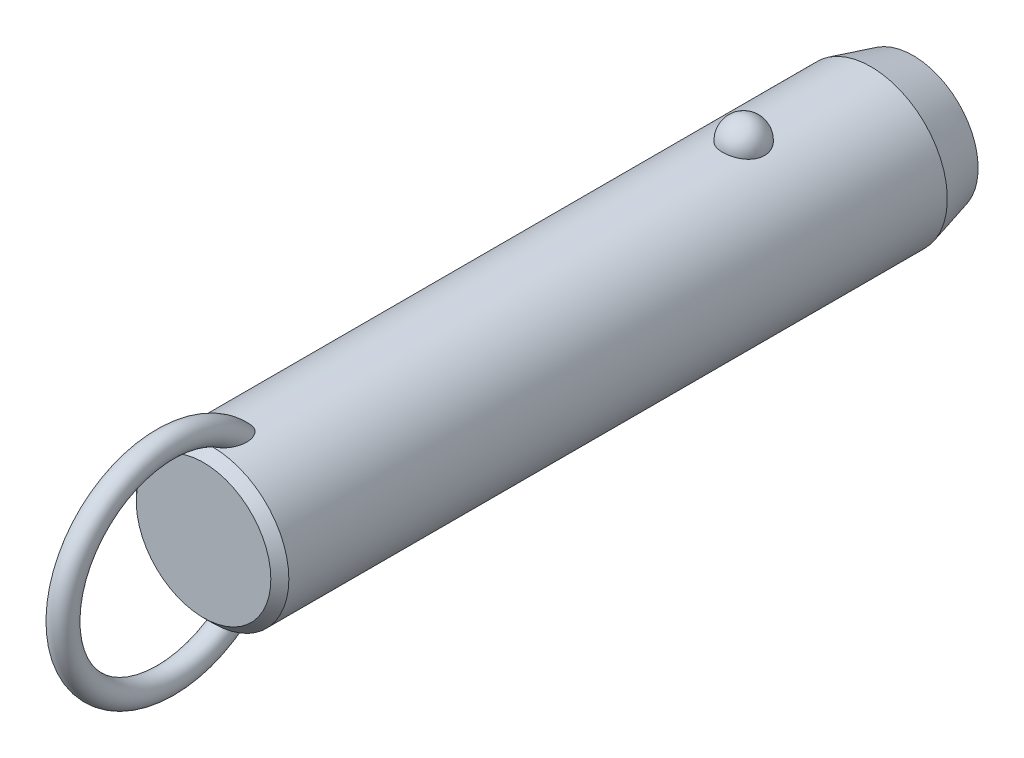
ISO-10303-21;
HEADER;
FILE_DESCRIPTION(('STEP AP214'),'2;1');
FILE_NAME('part.step','',(''),(''),'','','');
FILE_SCHEMA(('AUTOMOTIVE_DESIGN { 1 0 10303 214 1 1 1 1 }'));
ENDSEC;
DATA;
#1=APPLICATION_CONTEXT('core data for automotive mechanical design processes');
#2=APPLICATION_PROTOCOL_DEFINITION('international standard','automotive_design',2000,#1);
#3=PRODUCT_CONTEXT('',#1,'mechanical');
#4=PRODUCT('Part','Part','',(#3));
#5=PRODUCT_RELATED_PRODUCT_CATEGORY('part','',(#4));
#6=PRODUCT_DEFINITION_FORMATION('','',#4);
#7=PRODUCT_DEFINITION_CONTEXT('part definition',#1,'design');
#8=PRODUCT_DEFINITION('design','',#6,#7);
#9=PRODUCT_DEFINITION_SHAPE('','',#8);
#10=(LENGTH_UNIT() NAMED_UNIT(*) SI_UNIT(.MILLI.,.METRE.));
#11=(NAMED_UNIT(*) PLANE_ANGLE_UNIT() SI_UNIT($,.RADIAN.));
#12=(NAMED_UNIT(*) SI_UNIT($,.STERADIAN.) SOLID_ANGLE_UNIT());
#13=UNCERTAINTY_MEASURE_WITH_UNIT(LENGTH_MEASURE(1.E-05),#10,'distance_accuracy_value','');
#14=(GEOMETRIC_REPRESENTATION_CONTEXT(3) GLOBAL_UNCERTAINTY_ASSIGNED_CONTEXT((#13)) GLOBAL_UNIT_ASSIGNED_CONTEXT((#10,
#11,#12)) REPRESENTATION_CONTEXT('',''));
#15=CARTESIAN_POINT('',(0.,0.,0.));
#16=DIRECTION('',(0.,0.,1.));
#17=DIRECTION('',(1.,0.,0.));
#18=AXIS2_PLACEMENT_3D('',#15,#16,#17);
#19=CARTESIAN_POINT('',(0.,0.,73.7));
#20=DIRECTION('',(0.,0.,-1.));
#21=DIRECTION('',(-1.,0.,0.));
#22=AXIS2_PLACEMENT_3D('',#19,#20,#21);
#23=CYLINDRICAL_SURFACE('',#22,12.7);
#24=CARTESIAN_POINT('',(3.46661256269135,12.2177165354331,-3.5));
#25=CARTESIAN_POINT('',(3.4666090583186,12.2177194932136,-3.30432790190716));
#26=CARTESIAN_POINT('',(3.45063567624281,12.2222841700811,-3.10861112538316));
#27=CARTESIAN_POINT('',(3.38712451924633,12.2400345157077,-2.72271899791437));
#28=CARTESIAN_POINT('',(3.33957415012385,12.2532236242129,-2.53254588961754));
#29=CARTESIAN_POINT('',(3.2141234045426,12.286724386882,-2.16324948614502));
#30=CARTESIAN_POINT('',(3.13623639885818,12.3070329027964,-1.98412136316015));
#31=CARTESIAN_POINT('',(2.95205930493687,12.3525018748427,-1.64180592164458));
#32=CARTESIAN_POINT('',(2.84577003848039,12.3776621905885,-1.47861814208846));
#33=CARTESIAN_POINT('',(2.60688050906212,12.4301712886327,-1.17190583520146));
#34=CARTESIAN_POINT('',(2.47415697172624,12.4575299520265,-1.02847897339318));
#35=CARTESIAN_POINT('',(2.18615174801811,12.5112810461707,-0.766177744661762));
#36=CARTESIAN_POINT('',(2.03087002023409,12.5376734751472,-0.64730342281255));
#37=CARTESIAN_POINT('',(1.70237334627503,12.5864761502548,-0.437732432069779));
#38=CARTESIAN_POINT('',(1.52920948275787,12.6088972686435,-0.346958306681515));
#39=CARTESIAN_POINT('',(1.16944170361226,12.6473352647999,-0.195750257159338));
#40=CARTESIAN_POINT('',(0.982839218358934,12.663352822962,-0.135313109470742));
#41=CARTESIAN_POINT('',(0.604961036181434,12.6869706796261,-0.0473241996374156));
#42=CARTESIAN_POINT('',(0.41382314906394,12.6947125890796,-0.0192185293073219));
#43=CARTESIAN_POINT('',(0.0293827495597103,12.7014203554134,0.0051725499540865));
#44=CARTESIAN_POINT('',(-0.163919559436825,12.7003870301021,0.00146092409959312));
#45=CARTESIAN_POINT('',(-0.544374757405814,12.689735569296,-0.0373939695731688));
#46=CARTESIAN_POINT('',(-0.731575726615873,12.6802364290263,-0.0721015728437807));
#47=CARTESIAN_POINT('',(-1.09733277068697,12.6538333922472,-0.171364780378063));
#48=CARTESIAN_POINT('',(-1.27588869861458,12.6369293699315,-0.235920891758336));
#49=CARTESIAN_POINT('',(-1.6204698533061,12.5973946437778,-0.393548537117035));
#50=CARTESIAN_POINT('',(-1.78641865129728,12.5747321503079,-0.486778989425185));
#51=CARTESIAN_POINT('',(-2.10030671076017,12.5261316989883,-0.699110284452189));
#52=CARTESIAN_POINT('',(-2.24824419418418,12.5001934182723,-0.818213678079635));
#53=CARTESIAN_POINT('',(-2.52491489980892,12.4472906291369,-1.08157124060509));
#54=CARTESIAN_POINT('',(-2.65324222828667,12.4203160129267,-1.22624992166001));
#55=CARTESIAN_POINT('',(-2.88410007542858,12.3687509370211,-1.53528325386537));
#56=CARTESIAN_POINT('',(-2.98662883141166,12.3441606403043,-1.69963924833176));
#57=CARTESIAN_POINT('',(-3.16432417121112,12.2998199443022,-2.04548497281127));
#58=CARTESIAN_POINT('',(-3.23917525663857,12.2801261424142,-2.22714424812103));
#59=CARTESIAN_POINT('',(-3.35800573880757,12.248167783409,-2.6009138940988));
#60=CARTESIAN_POINT('',(-3.4019860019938,12.2359030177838,-2.79302397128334));
#61=CARTESIAN_POINT('',(-3.45784812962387,12.2202347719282,-3.18140279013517));
#62=CARTESIAN_POINT('',(-3.46986123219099,12.2167950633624,-3.37765118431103));
#63=CARTESIAN_POINT('',(-3.46186273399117,12.2190638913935,-3.76943689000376));
#64=CARTESIAN_POINT('',(-3.44185196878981,12.2247721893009,-3.96497421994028));
#65=CARTESIAN_POINT('',(-3.37048652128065,12.2446381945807,-4.34881728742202));
#66=CARTESIAN_POINT('',(-3.31928253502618,12.2587552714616,-4.53715319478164));
#67=CARTESIAN_POINT('',(-3.18693461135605,12.2938237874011,-4.90231727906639));
#68=CARTESIAN_POINT('',(-3.1057895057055,12.3147754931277,-5.07914500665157));
#69=CARTESIAN_POINT('',(-2.91506431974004,12.3613125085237,-5.41732059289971));
#70=CARTESIAN_POINT('',(-2.80533587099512,12.3869217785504,-5.57858147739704));
#71=CARTESIAN_POINT('',(-2.560414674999,12.4398525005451,-5.88013283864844));
#72=CARTESIAN_POINT('',(-2.42522099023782,12.4671740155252,-6.02042254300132));
#73=CARTESIAN_POINT('',(-2.1323357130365,12.5205965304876,-6.27662798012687));
#74=CARTESIAN_POINT('',(-1.97456596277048,12.5466928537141,-6.3924554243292));
#75=CARTESIAN_POINT('',(-1.64115839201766,12.5946384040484,-6.59583547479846));
#76=CARTESIAN_POINT('',(-1.46552179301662,12.6164879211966,-6.68339001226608));
#77=CARTESIAN_POINT('',(-1.10356050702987,12.6532533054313,-6.82682153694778));
#78=CARTESIAN_POINT('',(-0.9173913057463,12.6682500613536,-6.8830698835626));
#79=CARTESIAN_POINT('',(-0.537836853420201,12.6900288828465,-6.96386887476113));
#80=CARTESIAN_POINT('',(-0.344452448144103,12.6968119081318,-6.9884232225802));
#81=CARTESIAN_POINT('',(0.0402577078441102,12.7013667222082,-7.00496469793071));
#82=CARTESIAN_POINT('',(0.231556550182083,12.6993008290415,-6.99753844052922));
#83=CARTESIAN_POINT('',(0.610105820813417,12.6867505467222,-6.9516636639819));
#84=CARTESIAN_POINT('',(0.797356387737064,12.6762664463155,-6.913216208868));
#85=CARTESIAN_POINT('',(1.16186657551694,12.6480587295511,-6.80658431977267));
#86=CARTESIAN_POINT('',(1.33915951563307,12.6303611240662,-6.73850666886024));
#87=CARTESIAN_POINT('',(1.67968518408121,12.5896027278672,-6.5745087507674));
#88=CARTESIAN_POINT('',(1.84291705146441,12.5665416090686,-6.47858678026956));
#89=CARTESIAN_POINT('',(2.15340192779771,12.5171072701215,-6.25982455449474));
#90=CARTESIAN_POINT('',(2.30037831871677,12.4906895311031,-6.13660186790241));
#91=CARTESIAN_POINT('',(2.5717412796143,12.4376567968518,-5.86739587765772));
#92=CARTESIAN_POINT('',(2.69612388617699,12.4110417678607,-5.72140858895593));
#93=CARTESIAN_POINT('',(2.92107785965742,12.360051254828,-5.40794137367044));
#94=CARTESIAN_POINT('',(3.02121329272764,12.3357209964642,-5.24014110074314));
#95=CARTESIAN_POINT('',(3.19236291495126,12.2925446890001,-4.88969865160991));
#96=CARTESIAN_POINT('',(3.26338839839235,12.2736965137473,-4.70706226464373));
#97=CARTESIAN_POINT('',(3.36788038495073,12.245404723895,-4.35469510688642));
#98=CARTESIAN_POINT('',(3.40484026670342,12.2351018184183,-4.18605935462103));
#99=CARTESIAN_POINT('',(3.45420764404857,12.2212564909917,-3.84496058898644));
#100=CARTESIAN_POINT('',(3.46661565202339,12.2177139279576,-3.67249765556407));
#101=CARTESIAN_POINT('',(3.46661256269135,12.2177165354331,-3.5));
#102=B_SPLINE_CURVE_WITH_KNOTS('',3,(#24,#25,#26,#27,#28,#29,#30,#31,#32,#33,#34,#35,#36,#37,
#38,#39,#40,#41,#42,#43,#44,#45,#46,#47,#48,#49,#50,#51,#52,#53,#54,#55,#56,#57,#58,#59,#60,#61,
#62,#63,#64,#65,#66,#67,#68,#69,#70,#71,#72,#73,#74,#75,#76,#77,#78,#79,#80,#81,#82,#83,#84,#85,
#86,#87,#88,#89,#90,#91,#92,#93,#94,#95,#96,#97,#98,#99,#100,#101),.UNSPECIFIED.,.T.,.F.,(4,2,2,
2,2,2,2,2,2,2,2,2,2,2,2,2,2,2,2,2,2,2,2,2,2,2,2,2,2,2,2,2,2,2,2,2,2,2,4),(0.,0.586396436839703,
1.17302689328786,1.7593990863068,2.34575431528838,2.93491084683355,3.52406845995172,
4.11158733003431,4.69904375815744,5.2762784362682,5.85345931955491,6.42265312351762,
6.99185659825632,7.56427334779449,8.136746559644,8.71981013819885,9.3029135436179,
9.89247258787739,10.4820150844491,11.0691335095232,11.6562366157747,12.2405256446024,
12.8248374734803,13.412244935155,13.9996740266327,14.5891883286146,15.1786623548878,
15.7609861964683,16.3432419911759,16.9148635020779,17.4864654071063,18.0560241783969,
18.6256177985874,19.2037609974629,19.7820055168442,20.3699810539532,20.957728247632,
21.4746855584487,21.9916320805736),.UNSPECIFIED.);
#103=CARTESIAN_POINT('',(3.46661256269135,12.2177165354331,-3.5));
#104=VERTEX_POINT('',#103);
#105=EDGE_CURVE('E41',#104,#104,#102,.T.);
#106=ORIENTED_EDGE('',*,*,#105,.T.);
#107=EDGE_LOOP('',(#106));
#108=FACE_BOUND('',#107,.T.);
#109=CARTESIAN_POINT('',(0.,0.,84.9));
#110=DIRECTION('',(0.,0.,1.));
#111=DIRECTION('',(1.,0.,0.));
#112=AXIS2_PLACEMENT_3D('',#109,#110,#111);
#113=CIRCLE('',#112,12.7);
#114=CARTESIAN_POINT('',(12.7,0.,84.9));
#115=VERTEX_POINT('',#114);
#116=EDGE_CURVE('E10',#115,#115,#113,.F.);
#117=ORIENTED_EDGE('',*,*,#116,.T.);
#118=EDGE_LOOP('',(#117));
#119=FACE_BOUND('',#118,.T.);
#120=CARTESIAN_POINT('',(-0.548122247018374,-12.6881662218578,78.6432187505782));
#121=CARTESIAN_POINT('',(-0.64886572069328,-12.6838128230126,78.677926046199));
#122=CARTESIAN_POINT('',(-0.746398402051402,-12.6783867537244,78.7220428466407));
#123=CARTESIAN_POINT('',(-0.93212506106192,-12.666091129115,78.8267647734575));
#124=CARTESIAN_POINT('',(-1.02030388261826,-12.6592192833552,78.887396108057));
#125=CARTESIAN_POINT('',(-1.18487740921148,-12.6448747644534,79.021847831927));
#126=CARTESIAN_POINT('',(-1.26134296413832,-12.637406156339,79.0955825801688));
#127=CARTESIAN_POINT('',(-1.4023120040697,-12.6225412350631,79.2536045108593));
#128=CARTESIAN_POINT('',(-1.46681470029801,-12.6151449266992,79.3378923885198));
#129=CARTESIAN_POINT('',(-1.60714786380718,-12.5981718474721,79.5496577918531));
#130=CARTESIAN_POINT('',(-1.67725126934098,-12.588900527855,79.680962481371));
#131=CARTESIAN_POINT('',(-1.79536591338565,-12.5725964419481,79.9532471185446));
#132=CARTESIAN_POINT('',(-1.84333535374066,-12.5655679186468,80.0942447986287));
#133=CARTESIAN_POINT('',(-1.93422576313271,-12.5519624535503,80.4376455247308));
#134=CARTESIAN_POINT('',(-1.96788773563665,-12.5466298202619,80.6425578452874));
#135=CARTESIAN_POINT('',(-1.9941399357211,-12.542463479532,80.9517600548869));
#136=CARTESIAN_POINT('',(-1.99883864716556,-12.5417153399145,81.0552987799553));
#137=CARTESIAN_POINT('',(-2.00078003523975,-12.5414074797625,81.2624512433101));
#138=CARTESIAN_POINT('',(-1.99802449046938,-12.5418474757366,81.3660649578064));
#139=CARTESIAN_POINT('',(-1.98336733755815,-12.5441750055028,81.6103207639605));
#140=CARTESIAN_POINT('',(-1.96851430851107,-12.5465291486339,81.7507804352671));
#141=CARTESIAN_POINT('',(-1.92707089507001,-12.5529612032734,82.0299607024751));
#142=CARTESIAN_POINT('',(-1.900474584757,-12.5570399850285,82.1686803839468));
#143=CARTESIAN_POINT('',(-1.83619120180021,-12.5666008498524,82.4434113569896));
#144=CARTESIAN_POINT('',(-1.79850828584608,-12.57208240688,82.5794236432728));
#145=CARTESIAN_POINT('',(-1.71223796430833,-12.5841228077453,82.8478421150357));
#146=CARTESIAN_POINT('',(-1.6636567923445,-12.5906810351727,82.9802503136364));
#147=CARTESIAN_POINT('',(-1.57804503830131,-12.6016176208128,83.1854887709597));
#148=CARTESIAN_POINT('',(-1.54477252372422,-12.6057501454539,83.2599149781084));
#149=CARTESIAN_POINT('',(-1.47424480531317,-12.6141930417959,83.4068393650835));
#150=CARTESIAN_POINT('',(-1.43699041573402,-12.6185033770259,83.4793379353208));
#151=CARTESIAN_POINT('',(-1.35825795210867,-12.6272207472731,83.6218926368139));
#152=CARTESIAN_POINT('',(-1.31678520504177,-12.6316276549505,83.6919517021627));
#153=CARTESIAN_POINT('',(-1.22917793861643,-12.6404532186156,83.8290705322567));
#154=CARTESIAN_POINT('',(-1.18304514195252,-12.6448718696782,83.8961313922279));
#155=CARTESIAN_POINT('',(-1.07246411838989,-12.6547893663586,84.0438741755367));
#156=CARTESIAN_POINT('',(-1.00642239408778,-12.6602600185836,84.1233844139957));
#157=CARTESIAN_POINT('',(-0.864441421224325,-12.6707460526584,84.2731698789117));
#158=CARTESIAN_POINT('',(-0.788516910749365,-12.6757620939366,84.3434585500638));
#159=CARTESIAN_POINT('',(-0.652215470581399,-12.6833591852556,84.4486801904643));
#160=CARTESIAN_POINT('',(-0.594982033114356,-12.6861973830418,84.4876241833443));
#161=CARTESIAN_POINT('',(-0.475269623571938,-12.6912445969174,84.5564899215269));
#162=CARTESIAN_POINT('',(-0.412800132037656,-12.6934547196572,84.5864275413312));
#163=CARTESIAN_POINT('',(-0.295749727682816,-12.6966636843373,84.6297565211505));
#164=CARTESIAN_POINT('',(-0.241949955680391,-12.6978134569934,84.6452188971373));
#165=CARTESIAN_POINT('',(-0.132508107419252,-12.6994261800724,84.6668845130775));
#166=CARTESIAN_POINT('',(-0.0768679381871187,-12.6998898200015,84.6730970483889));
#167=CARTESIAN_POINT('',(0.0347696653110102,-12.7000752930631,84.6755838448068));
#168=CARTESIAN_POINT('',(0.090767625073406,-12.6997954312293,84.6718353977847));
#169=CARTESIAN_POINT('',(0.201283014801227,-12.6985255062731,84.6547883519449));
#170=CARTESIAN_POINT('',(0.255799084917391,-12.6975348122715,84.6414812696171));
#171=CARTESIAN_POINT('',(0.376042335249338,-12.6946091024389,84.6020379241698));
#172=CARTESIAN_POINT('',(0.440950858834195,-12.6924943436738,84.5734492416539));
#173=CARTESIAN_POINT('',(0.565350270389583,-12.6875639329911,84.5063234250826));
#174=CARTESIAN_POINT('',(0.624828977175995,-12.6847467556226,84.4677646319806));
#175=CARTESIAN_POINT('',(0.774116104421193,-12.6767252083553,84.356949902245));
#176=CARTESIAN_POINT('',(0.859449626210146,-12.6711344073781,84.2787605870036));
#177=CARTESIAN_POINT('',(1.01789440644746,-12.6593922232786,84.110943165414));
#178=CARTESIAN_POINT('',(1.09096902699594,-12.653239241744,84.021282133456));
#179=CARTESIAN_POINT('',(1.22268793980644,-12.6411674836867,83.840265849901));
#180=CARTESIAN_POINT('',(1.28193986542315,-12.6352572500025,83.749345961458));
#181=CARTESIAN_POINT('',(1.39259777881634,-12.6235401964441,83.5627929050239));
#182=CARTESIAN_POINT('',(1.44399707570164,-12.6177334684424,83.4671558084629));
#183=CARTESIAN_POINT('',(1.53972870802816,-12.6064093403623,83.2722738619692));
#184=CARTESIAN_POINT('',(1.58405262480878,-12.6008922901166,83.1730248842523));
#185=CARTESIAN_POINT('',(1.66600705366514,-12.5903187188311,82.9717727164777));
#186=CARTESIAN_POINT('',(1.70363651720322,-12.5852622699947,82.8697690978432));
#187=CARTESIAN_POINT('',(1.77545379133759,-12.5753406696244,82.6543580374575));
#188=CARTESIAN_POINT('',(1.80903453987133,-12.5705328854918,82.540745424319));
#189=CARTESIAN_POINT('',(1.86844163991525,-12.5618400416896,82.3114575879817));
#190=CARTESIAN_POINT('',(1.89426665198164,-12.5579551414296,82.1957820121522));
#191=CARTESIAN_POINT('',(1.93785464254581,-12.5513030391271,81.9630072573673));
#192=CARTESIAN_POINT('',(1.95562640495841,-12.5485346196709,81.8459097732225));
#193=CARTESIAN_POINT('',(1.98264463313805,-12.5442934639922,81.6107473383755));
#194=CARTESIAN_POINT('',(1.99189298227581,-12.5428204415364,81.4926826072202));
#195=CARTESIAN_POINT('',(2.00416068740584,-12.540871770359,81.1806225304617));
#196=CARTESIAN_POINT('',(1.99944433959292,-12.541631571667,80.986229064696));
#197=CARTESIAN_POINT('',(1.96113755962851,-12.5476846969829,80.6003095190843));
#198=CARTESIAN_POINT('',(1.92758341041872,-12.5529723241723,80.4087801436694));
#199=CARTESIAN_POINT('',(1.83934342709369,-12.5661532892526,80.0822728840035));
#200=CARTESIAN_POINT('',(1.79215440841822,-12.5730485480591,79.9452499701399));
#201=CARTESIAN_POINT('',(1.67676242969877,-12.588958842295,79.6804459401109));
#202=CARTESIAN_POINT('',(1.60859050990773,-12.597970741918,79.5526515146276));
#203=CARTESIAN_POINT('',(1.46583832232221,-12.6152829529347,79.3358006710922));
#204=CARTESIAN_POINT('',(1.39525727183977,-12.6233659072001,79.2441050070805));
#205=CARTESIAN_POINT('',(1.23992594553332,-12.6395676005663,79.0734854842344));
#206=CARTESIAN_POINT('',(1.15517932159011,-12.6476863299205,78.9945583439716));
#207=CARTESIAN_POINT('',(0.971995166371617,-12.6630846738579,78.8526438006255));
#208=CARTESIAN_POINT('',(0.873456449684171,-12.6703572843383,78.7897849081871));
#209=CARTESIAN_POINT('',(0.665847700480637,-12.6829569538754,78.6844870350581));
#210=CARTESIAN_POINT('',(0.556784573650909,-12.688285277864,78.6420347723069));
#211=CARTESIAN_POINT('',(0.347338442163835,-12.6956226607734,78.5844434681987));
#212=CARTESIAN_POINT('',(0.247759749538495,-12.6979816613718,78.5663996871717));
#213=CARTESIAN_POINT('',(0.0470218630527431,-12.7003077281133,78.5486007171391));
#214=CARTESIAN_POINT('',(-0.0541350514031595,-12.7002779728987,78.5488212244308));
#215=CARTESIAN_POINT('',(-0.221414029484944,-12.6982482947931,78.5643639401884));
#216=CARTESIAN_POINT('',(-0.288055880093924,-12.6969033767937,78.5746662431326));
#217=CARTESIAN_POINT('',(-0.419599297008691,-12.6932369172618,78.6031348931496));
#218=CARTESIAN_POINT('',(-0.484501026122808,-12.6909154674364,78.6213005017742));
#219=CARTESIAN_POINT('',(-0.548122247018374,-12.6881662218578,78.6432187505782));
#220=B_SPLINE_CURVE_WITH_KNOTS('',3,(#120,#121,#122,#123,#124,#125,#126,#127,#128,#129,#130,
#131,#132,#133,#134,#135,#136,#137,#138,#139,#140,#141,#142,#143,#144,#145,#146,#147,#148,#149,
#150,#151,#152,#153,#154,#155,#156,#157,#158,#159,#160,#161,#162,#163,#164,#165,#166,#167,#168,
#169,#170,#171,#172,#173,#174,#175,#176,#177,#178,#179,#180,#181,#182,#183,#184,#185,#186,#187,
#188,#189,#190,#191,#192,#193,#194,#195,#196,#197,#198,#199,#200,#201,#202,#203,#204,#205,#206,
#207,#208,#209,#210,#211,#212,#213,#214,#215,#216,#217,#218,#219),.UNSPECIFIED.,.T.,.F.,(4,2,2,
2,2,2,2,2,2,2,2,2,2,2,2,2,2,2,2,2,2,2,2,2,2,2,2,2,2,2,2,2,2,2,2,2,2,2,2,2,2,2,2,2,2,2,2,2,2,4),
(0.,0.319642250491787,0.639794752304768,0.957927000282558,1.27608021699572,1.72100165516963,
2.16675988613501,2.78630021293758,3.09705782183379,3.40774128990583,3.83096358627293,
4.25439969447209,4.67767724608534,5.1007133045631,5.34550297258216,5.59024267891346,
5.83467707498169,6.07902143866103,6.38891080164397,6.69834321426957,6.90560910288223,
7.11250749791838,7.279773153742,7.44687060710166,7.6143493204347,7.78197685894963,
7.99365544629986,8.20579780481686,8.55147335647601,8.89816429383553,9.22375138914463,
9.54961437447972,9.87586224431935,10.202161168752,10.5575872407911,10.9130746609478,
11.2681734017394,11.6231936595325,12.2046601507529,12.7853961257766,13.219164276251,
13.6522938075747,13.9989174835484,14.3454519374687,14.6946768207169,15.0436740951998,
15.3457513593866,15.6474266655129,15.8493051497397,16.0511646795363),.UNSPECIFIED.);
#221=CARTESIAN_POINT('',(-0.548122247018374,-12.6881662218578,78.6432187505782));
#222=VERTEX_POINT('',#221);
#223=EDGE_CURVE('E60',#222,#222,#220,.T.);
#224=ORIENTED_EDGE('',*,*,#223,.T.);
#225=EDGE_LOOP('',(#224));
#226=FACE_BOUND('',#225,.T.);
#227=CARTESIAN_POINT('',(-0.548122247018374,12.6881662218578,78.6432187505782));
#228=CARTESIAN_POINT('',(-0.459436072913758,12.6919968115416,78.612673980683));
#229=CARTESIAN_POINT('',(-0.368189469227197,12.6949996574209,78.5893913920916));
#230=CARTESIAN_POINT('',(-0.183024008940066,12.6990186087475,78.5584062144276));
#231=CARTESIAN_POINT('',(-0.0891049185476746,12.7000345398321,78.5507049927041));
#232=CARTESIAN_POINT('',(0.0987147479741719,12.6999636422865,78.5512455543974));
#233=CARTESIAN_POINT('',(0.192615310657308,12.6988761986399,78.5594920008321));
#234=CARTESIAN_POINT('',(0.377658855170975,12.6947211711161,78.5915515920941));
#235=CARTESIAN_POINT('',(0.468801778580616,12.6916535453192,78.6153650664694));
#236=CARTESIAN_POINT('',(0.645809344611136,12.6838788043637,78.6774565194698));
#237=CARTESIAN_POINT('',(0.731679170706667,12.6791733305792,78.715720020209));
#238=CARTESIAN_POINT('',(0.896315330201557,12.6686004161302,78.805120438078));
#239=CARTESIAN_POINT('',(0.975080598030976,12.6627328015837,78.8562592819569));
#240=CARTESIAN_POINT('',(1.12963655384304,12.6499161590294,78.9736782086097));
#241=CARTESIAN_POINT('',(1.20478673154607,12.6429194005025,79.0407929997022));
#242=CARTESIAN_POINT('',(1.34448241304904,12.6288282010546,79.1852250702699));
#243=CARTESIAN_POINT('',(1.40902173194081,12.621733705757,79.2625482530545));
#244=CARTESIAN_POINT('',(1.55208211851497,12.6050877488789,79.4592475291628));
#245=CARTESIAN_POINT('',(1.62510490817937,12.5957546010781,79.5826540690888));
#246=CARTESIAN_POINT('',(1.7501904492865,12.5789823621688,79.8397690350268));
#247=CARTESIAN_POINT('',(1.80221377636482,12.5715468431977,79.973496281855));
#248=CARTESIAN_POINT('',(1.90309965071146,12.5567434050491,80.2983516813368));
#249=CARTESIAN_POINT('',(1.94342317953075,12.5504515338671,80.4921611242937));
#250=CARTESIAN_POINT('',(1.99332997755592,12.5426147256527,80.8837881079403));
#251=CARTESIAN_POINT('',(2.00285305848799,12.5410790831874,81.0816127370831));
#252=CARTESIAN_POINT('',(1.99678999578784,12.5420407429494,81.4166427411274));
#253=CARTESIAN_POINT('',(1.98794117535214,12.5434564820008,81.5540428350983));
#254=CARTESIAN_POINT('',(1.95865119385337,12.5480641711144,81.8276394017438));
#255=CARTESIAN_POINT('',(1.9382043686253,12.5512569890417,81.9638352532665));
#256=CARTESIAN_POINT('',(1.88647896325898,12.5591352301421,82.2342493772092));
#257=CARTESIAN_POINT('',(1.85518800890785,12.5638223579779,82.3684652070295));
#258=CARTESIAN_POINT('',(1.78217886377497,12.5743868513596,82.6339362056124));
#259=CARTESIAN_POINT('',(1.74046509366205,12.5802637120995,82.7651926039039));
#260=CARTESIAN_POINT('',(1.66024095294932,12.5910571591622,82.9860855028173));
#261=CARTESIAN_POINT('',(1.62434772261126,12.5957535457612,83.0766904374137));
#262=CARTESIAN_POINT('',(1.54709009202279,12.6054762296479,83.2555125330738));
#263=CARTESIAN_POINT('',(1.50572681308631,12.6105024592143,83.3437301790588));
#264=CARTESIAN_POINT('',(1.41728020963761,12.620748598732,83.5169321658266));
#265=CARTESIAN_POINT('',(1.37021377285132,12.625967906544,83.6019251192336));
#266=CARTESIAN_POINT('',(1.2696962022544,12.6364721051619,83.7680072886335));
#267=CARTESIAN_POINT('',(1.21624929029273,12.6417569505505,83.8490990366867));
#268=CARTESIAN_POINT('',(1.10304413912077,12.6521331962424,84.0047027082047));
#269=CARTESIAN_POINT('',(1.04340936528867,12.657226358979,84.0793033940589));
#270=CARTESIAN_POINT('',(0.915919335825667,12.6670906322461,84.221324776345));
#271=CARTESIAN_POINT('',(0.848064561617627,12.6718617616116,84.2887458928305));
#272=CARTESIAN_POINT('',(0.717035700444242,12.67987711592,84.4006247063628));
#273=CARTESIAN_POINT('',(0.655526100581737,12.6832377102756,84.4469970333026));
#274=CARTESIAN_POINT('',(0.525985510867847,12.6892676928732,84.5296195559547));
#275=CARTESIAN_POINT('',(0.457969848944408,12.6919386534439,84.5658927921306));
#276=CARTESIAN_POINT('',(0.334859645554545,12.695691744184,84.6166572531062));
#277=CARTESIAN_POINT('',(0.281116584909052,12.6970073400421,84.6343733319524));
#278=CARTESIAN_POINT('',(0.17142581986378,12.6989609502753,84.6606429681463));
#279=CARTESIAN_POINT('',(0.11548082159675,12.699599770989,84.6692074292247));
#280=CARTESIAN_POINT('',(0.00272618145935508,12.7001251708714,84.6762531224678));
#281=CARTESIAN_POINT('',(-0.0540859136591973,12.7000089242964,84.6746964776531));
#282=CARTESIAN_POINT('',(-0.166544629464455,12.6990328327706,84.6616005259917));
#283=CARTESIAN_POINT('',(-0.222190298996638,12.6981724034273,84.6500533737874));
#284=CARTESIAN_POINT('',(-0.342018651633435,12.695562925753,84.6149128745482));
#285=CARTESIAN_POINT('',(-0.405606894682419,12.6936676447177,84.5893322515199));
#286=CARTESIAN_POINT('',(-0.527815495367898,12.6891754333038,84.5283111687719));
#287=CARTESIAN_POINT('',(-0.586425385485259,12.6865770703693,84.4928505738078));
#288=CARTESIAN_POINT('',(-0.731842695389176,12.6792129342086,84.3914960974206));
#289=CARTESIAN_POINT('',(-0.814709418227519,12.6740767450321,84.3200395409));
#290=CARTESIAN_POINT('',(-0.969101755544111,12.6632083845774,84.1658900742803));
#291=CARTESIAN_POINT('',(-1.04059564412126,12.6574746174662,84.0831668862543));
#292=CARTESIAN_POINT('',(-1.16981116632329,12.6461638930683,83.9158096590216));
#293=CARTESIAN_POINT('',(-1.22811369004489,12.6405994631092,83.8316166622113));
#294=CARTESIAN_POINT('',(-1.33743405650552,12.6295007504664,83.6585791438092));
#295=CARTESIAN_POINT('',(-1.38844577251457,12.6239664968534,83.5697307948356));
#296=CARTESIAN_POINT('',(-1.48400702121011,12.6130898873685,83.3883895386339));
#297=CARTESIAN_POINT('',(-1.52854232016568,12.6077479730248,83.2958891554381));
#298=CARTESIAN_POINT('',(-1.6115011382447,12.5974127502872,83.1081607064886));
#299=CARTESIAN_POINT('',(-1.64992317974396,12.5924195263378,83.0129319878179));
#300=CARTESIAN_POINT('',(-1.73468589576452,12.581070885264,82.7828936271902));
#301=CARTESIAN_POINT('',(-1.77831261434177,12.5749388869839,82.6470661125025));
#302=CARTESIAN_POINT('',(-1.85439734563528,12.5639437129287,82.3722128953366));
#303=CARTESIAN_POINT('',(-1.88684994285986,12.5590811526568,82.2331856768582));
#304=CARTESIAN_POINT('',(-1.94008483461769,12.550968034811,81.9530923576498));
#305=CARTESIAN_POINT('',(-1.96088706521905,12.5477147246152,81.8120301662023));
#306=CARTESIAN_POINT('',(-1.99000539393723,12.5431291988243,81.5286689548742));
#307=CARTESIAN_POINT('',(-1.99832911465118,12.5417958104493,81.3863707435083));
#308=CARTESIAN_POINT('',(-2.00166624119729,12.5412674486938,81.0576271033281));
#309=CARTESIAN_POINT('',(-1.99178843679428,12.5428579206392,80.871088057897));
#310=CARTESIAN_POINT('',(-1.9445518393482,12.5502731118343,80.5016240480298));
#311=CARTESIAN_POINT('',(-1.90724032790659,12.5560905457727,80.3186934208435));
#312=CARTESIAN_POINT('',(-1.81330718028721,12.5699462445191,80.0048488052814));
#313=CARTESIAN_POINT('',(-1.76338820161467,12.5771273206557,79.8719105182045));
#314=CARTESIAN_POINT('',(-1.64305018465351,12.593414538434,79.6156813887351));
#315=CARTESIAN_POINT('',(-1.57265346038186,12.6025185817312,79.492380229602));
#316=CARTESIAN_POINT('',(-1.42634956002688,12.6198178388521,79.2835648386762));
#317=CARTESIAN_POINT('',(-1.35423772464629,12.6278405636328,79.1953846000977));
#318=CARTESIAN_POINT('',(-1.19645664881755,12.6437632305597,79.0321079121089));
#319=CARTESIAN_POINT('',(-1.11080536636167,12.6516633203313,78.9569944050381));
#320=CARTESIAN_POINT('',(-0.947219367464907,12.6648319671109,78.8378114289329));
#321=CARTESIAN_POINT('',(-0.871624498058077,12.670300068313,78.7905414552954));
#322=CARTESIAN_POINT('',(-0.714161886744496,12.6801492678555,78.7077413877));
#323=CARTESIAN_POINT('',(-0.632295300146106,12.684530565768,78.6722091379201));
#324=CARTESIAN_POINT('',(-0.548122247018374,12.6881662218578,78.6432187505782));
#325=B_SPLINE_CURVE_WITH_KNOTS('',3,(#227,#228,#229,#230,#231,#232,#233,#234,#235,#236,#237,
#238,#239,#240,#241,#242,#243,#244,#245,#246,#247,#248,#249,#250,#251,#252,#253,#254,#255,#256,
#257,#258,#259,#260,#261,#262,#263,#264,#265,#266,#267,#268,#269,#270,#271,#272,#273,#274,#275,
#276,#277,#278,#279,#280,#281,#282,#283,#284,#285,#286,#287,#288,#289,#290,#291,#292,#293,#294,
#295,#296,#297,#298,#299,#300,#301,#302,#303,#304,#305,#306,#307,#308,#309,#310,#311,#312,#313,
#314,#315,#316,#317,#318,#319,#320,#321,#322,#323,#324),.UNSPECIFIED.,.T.,.F.,(4,2,2,2,2,2,2,2,
2,2,2,2,2,2,2,2,2,2,2,2,2,2,2,2,2,2,2,2,2,2,2,2,2,2,2,2,2,2,2,2,2,2,2,2,2,2,2,2,4),(0.,
0.281328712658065,0.562682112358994,0.844117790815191,1.12555942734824,1.40671982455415,
1.68792232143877,1.98972294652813,2.29169886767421,2.72039860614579,3.14989948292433,
3.74084916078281,4.33295293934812,4.74554109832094,5.15833092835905,5.57159335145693,
5.98468079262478,6.27722775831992,6.56971484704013,6.86135609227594,7.15280542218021,
7.43927407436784,7.72572595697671,7.9563586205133,8.18646071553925,8.35559393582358,
8.52452541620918,8.69408946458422,8.86378678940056,9.06834348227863,9.27332014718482,
9.60010414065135,9.92778432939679,10.2350252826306,10.5425229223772,10.8506864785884,
11.1589244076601,11.5867893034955,12.0148612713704,12.4421984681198,12.8692745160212,
13.4279365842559,13.9856380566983,14.4107062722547,14.8353130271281,15.1765567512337,
15.5173516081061,15.7844129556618,16.051425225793),.UNSPECIFIED.);
#326=CARTESIAN_POINT('',(-0.548122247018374,12.6881662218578,78.6432187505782));
#327=VERTEX_POINT('',#326);
#328=EDGE_CURVE('E67',#327,#327,#325,.T.);
#329=ORIENTED_EDGE('',*,*,#328,.T.);
#330=EDGE_LOOP('',(#329));
#331=FACE_BOUND('',#330,.T.);
#332=CARTESIAN_POINT('',(0.,0.,-24.6999999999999));
#333=DIRECTION('',(0.,0.,-1.));
#334=DIRECTION('',(-1.,0.,0.));
#335=AXIS2_PLACEMENT_3D('',#332,#333,#334);
#336=CIRCLE('',#335,12.7);
#337=CARTESIAN_POINT('',(-12.7,0.,-24.6999999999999));
#338=VERTEX_POINT('',#337);
#339=EDGE_CURVE('E57',#338,#338,#336,.F.);
#340=ORIENTED_EDGE('',*,*,#339,.T.);
#341=EDGE_LOOP('',(#340));
#342=FACE_BOUND('',#341,.T.);
#343=ADVANCED_FACE('F37',(#108,#119,#226,#331,#342),#23,.T.);
#344=CARTESIAN_POINT('',(0.,0.,-31.7));
#345=DIRECTION('',(0.,0.,-1.));
#346=DIRECTION('',(-1.,0.,0.));
#347=AXIS2_PLACEMENT_3D('',#344,#345,#346);
#348=PLANE('',#347);
#349=CARTESIAN_POINT('',(0.,0.,-31.7));
#350=DIRECTION('',(0.,0.,-1.));
#351=DIRECTION('',(-1.,0.,0.));
#352=AXIS2_PLACEMENT_3D('',#349,#350,#351);
#353=CIRCLE('',#352,10.8243556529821);
#354=CARTESIAN_POINT('',(-10.8243556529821,0.,-31.7));
#355=VERTEX_POINT('',#354);
#356=EDGE_CURVE('E66',#355,#355,#353,.T.);
#357=ORIENTED_EDGE('',*,*,#356,.T.);
#358=EDGE_LOOP('',(#357));
#359=FACE_BOUND('',#358,.T.);
#360=ADVANCED_FACE('F85',(#359),#348,.T.);
#361=CARTESIAN_POINT('',(0.,0.,-31.7));
#362=DIRECTION('',(0.,0.,1.));
#363=DIRECTION('',(1.,0.,0.));
#364=AXIS2_PLACEMENT_3D('',#361,#362,#363);
#365=CONICAL_SURFACE('',#364,10.8243556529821,0.261799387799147);
#366=ORIENTED_EDGE('',*,*,#339,.F.);
#367=EDGE_LOOP('',(#366));
#368=FACE_BOUND('',#367,.T.);
#369=ORIENTED_EDGE('',*,*,#356,.F.);
#370=EDGE_LOOP('',(#369));
#371=FACE_BOUND('',#370,.T.);
#372=ADVANCED_FACE('F83',(#368,#371),#365,.T.);
#373=CARTESIAN_POINT('',(0.,0.,86.4));
#374=DIRECTION('',(0.,0.,1.));
#375=DIRECTION('',(1.,0.,0.));
#376=AXIS2_PLACEMENT_3D('',#373,#374,#375);
#377=PLANE('',#376);
#378=CARTESIAN_POINT('',(0.,0.,86.4));
#379=DIRECTION('',(0.,0.,1.));
#380=DIRECTION('',(1.,0.,0.));
#381=AXIS2_PLACEMENT_3D('',#378,#379,#380);
#382=CIRCLE('',#381,11.2);
#383=CARTESIAN_POINT('',(11.2,0.,86.4));
#384=VERTEX_POINT('',#383);
#385=EDGE_CURVE('E50',#384,#384,#382,.T.);
#386=ORIENTED_EDGE('',*,*,#385,.T.);
#387=EDGE_LOOP('',(#386));
#388=FACE_BOUND('',#387,.T.);
#389=ADVANCED_FACE('F77',(#388),#377,.T.);
#390=CARTESIAN_POINT('',(0.,0.,92.75));
#391=DIRECTION('',(1.,0.,0.));
#392=DIRECTION('',(0.,0.,-1.));
#393=AXIS2_PLACEMENT_3D('',#390,#391,#392);
#394=TOROIDAL_SURFACE('',#393,17.05,2.);
#395=ORIENTED_EDGE('',*,*,#328,.F.);
#396=EDGE_LOOP('',(#395));
#397=FACE_BOUND('',#396,.T.);
#398=ORIENTED_EDGE('',*,*,#223,.F.);
#399=EDGE_LOOP('',(#398));
#400=FACE_BOUND('',#399,.T.);
#401=ADVANCED_FACE('F73',(#397,#400),#394,.T.);
#402=CARTESIAN_POINT('',(0.,0.,86.4));
#403=DIRECTION('',(0.,0.,-1.));
#404=DIRECTION('',(-1.,0.,0.));
#405=AXIS2_PLACEMENT_3D('',#402,#403,#404);
#406=CONICAL_SURFACE('',#405,11.2,0.785398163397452);
#407=ORIENTED_EDGE('',*,*,#116,.F.);
#408=EDGE_LOOP('',(#407));
#409=FACE_BOUND('',#408,.T.);
#410=ORIENTED_EDGE('',*,*,#385,.F.);
#411=EDGE_LOOP('',(#410));
#412=FACE_BOUND('',#411,.T.);
#413=ADVANCED_FACE('F39',(#409,#412),#406,.T.);
#414=CARTESIAN_POINT('',(0.,12.7,-3.5));
#415=DIRECTION('',(0.,1.,0.));
#416=DIRECTION('',(0.,0.,-1.));
#417=AXIS2_PLACEMENT_3D('',#414,#415,#416);
#418=SPHERICAL_SURFACE('',#417,3.5);
#419=ORIENTED_EDGE('',*,*,#105,.F.);
#420=EDGE_LOOP('',(#419));
#421=FACE_BOUND('',#420,.T.);
#422=ADVANCED_FACE('F79',(#421),#418,.T.);
#423=CLOSED_SHELL('',(#343,#360,#372,#389,#401,#413,#422));
#424=MANIFOLD_SOLID_BREP('B2',#423);
#425=ADVANCED_BREP_SHAPE_REPRESENTATION('',(#18,#424),#14);
#426=SHAPE_DEFINITION_REPRESENTATION(#9,#425);
ENDSEC;
END-ISO-10303-21;
